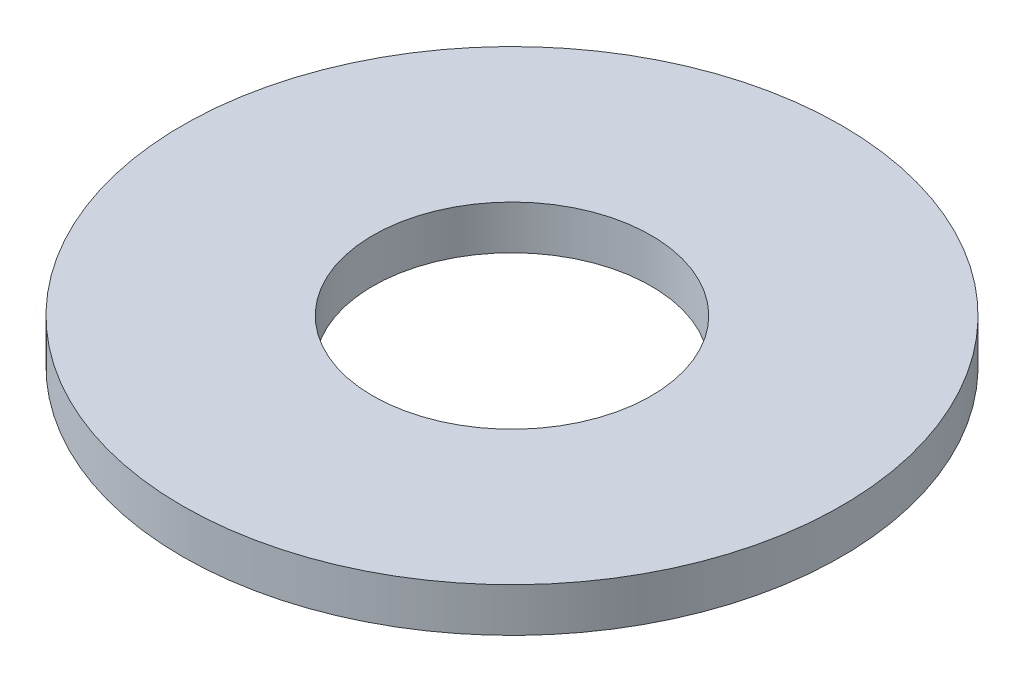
ISO-10303-21;
HEADER;
FILE_DESCRIPTION(('STEP AP214'),'2;1');
FILE_NAME('part.step','',(''),(''),'','','');
FILE_SCHEMA(('AUTOMOTIVE_DESIGN { 1 0 10303 214 1 1 1 1 }'));
ENDSEC;
DATA;
#1=APPLICATION_CONTEXT('core data for automotive mechanical design processes');
#2=APPLICATION_PROTOCOL_DEFINITION('international standard','automotive_design',2000,#1);
#3=PRODUCT_CONTEXT('',#1,'mechanical');
#4=PRODUCT('Part','Part','',(#3));
#5=PRODUCT_RELATED_PRODUCT_CATEGORY('part','',(#4));
#6=PRODUCT_DEFINITION_FORMATION('','',#4);
#7=PRODUCT_DEFINITION_CONTEXT('part definition',#1,'design');
#8=PRODUCT_DEFINITION('design','',#6,#7);
#9=PRODUCT_DEFINITION_SHAPE('','',#8);
#10=(LENGTH_UNIT() NAMED_UNIT(*) SI_UNIT(.MILLI.,.METRE.));
#11=(NAMED_UNIT(*) PLANE_ANGLE_UNIT() SI_UNIT($,.RADIAN.));
#12=(NAMED_UNIT(*) SI_UNIT($,.STERADIAN.) SOLID_ANGLE_UNIT());
#13=UNCERTAINTY_MEASURE_WITH_UNIT(LENGTH_MEASURE(1.E-05),#10,'distance_accuracy_value','');
#14=(GEOMETRIC_REPRESENTATION_CONTEXT(3) GLOBAL_UNCERTAINTY_ASSIGNED_CONTEXT((#13)) GLOBAL_UNIT_ASSIGNED_CONTEXT((#10,
#11,#12)) REPRESENTATION_CONTEXT('',''));
#15=CARTESIAN_POINT('',(0.,0.,0.));
#16=DIRECTION('',(0.,0.,1.));
#17=DIRECTION('',(1.,0.,0.));
#18=AXIS2_PLACEMENT_3D('',#15,#16,#17);
#19=CARTESIAN_POINT('',(0.,0.3,0.));
#20=DIRECTION('',(0.,1.,0.));
#21=DIRECTION('',(0.,0.,1.));
#22=AXIS2_PLACEMENT_3D('',#19,#20,#21);
#23=PLANE('',#22);
#24=CARTESIAN_POINT('',(0.,0.3,0.));
#25=DIRECTION('',(0.,1.,0.));
#26=DIRECTION('',(0.,0.,1.));
#27=AXIS2_PLACEMENT_3D('',#24,#25,#26);
#28=CIRCLE('',#27,2.25);
#29=CARTESIAN_POINT('',(0.,0.3,2.25));
#30=VERTEX_POINT('',#29);
#31=EDGE_CURVE('E10',#30,#30,#28,.T.);
#32=ORIENTED_EDGE('',*,*,#31,.T.);
#33=EDGE_LOOP('',(#32));
#34=FACE_BOUND('',#33,.T.);
#35=CARTESIAN_POINT('',(0.,0.3,0.));
#36=DIRECTION('',(0.,1.,0.));
#37=DIRECTION('',(0.,0.,1.));
#38=AXIS2_PLACEMENT_3D('',#35,#36,#37);
#39=CIRCLE('',#38,0.95);
#40=CARTESIAN_POINT('',(0.,0.3,0.95));
#41=VERTEX_POINT('',#40);
#42=EDGE_CURVE('E39',#41,#41,#39,.T.);
#43=ORIENTED_EDGE('',*,*,#42,.F.);
#44=EDGE_LOOP('',(#43));
#45=FACE_BOUND('',#44,.T.);
#46=ADVANCED_FACE('F28',(#34,#45),#23,.T.);
#47=CARTESIAN_POINT('',(0.,0.,0.));
#48=DIRECTION('',(0.,1.,0.));
#49=DIRECTION('',(0.,0.,1.));
#50=AXIS2_PLACEMENT_3D('',#47,#48,#49);
#51=PLANE('',#50);
#52=CARTESIAN_POINT('',(0.,0.,0.));
#53=DIRECTION('',(0.,1.,0.));
#54=DIRECTION('',(0.,0.,1.));
#55=AXIS2_PLACEMENT_3D('',#52,#53,#54);
#56=CIRCLE('',#55,2.25);
#57=CARTESIAN_POINT('',(0.,0.,2.25));
#58=VERTEX_POINT('',#57);
#59=EDGE_CURVE('E35',#58,#58,#56,.T.);
#60=ORIENTED_EDGE('',*,*,#59,.F.);
#61=EDGE_LOOP('',(#60));
#62=FACE_BOUND('',#61,.T.);
#63=CARTESIAN_POINT('',(0.,0.,0.));
#64=DIRECTION('',(0.,1.,0.));
#65=DIRECTION('',(0.,0.,1.));
#66=AXIS2_PLACEMENT_3D('',#63,#64,#65);
#67=CIRCLE('',#66,0.95);
#68=CARTESIAN_POINT('',(0.,0.,0.95));
#69=VERTEX_POINT('',#68);
#70=EDGE_CURVE('E43',#69,#69,#67,.T.);
#71=ORIENTED_EDGE('',*,*,#70,.T.);
#72=EDGE_LOOP('',(#71));
#73=FACE_BOUND('',#72,.T.);
#74=ADVANCED_FACE('F49',(#62,#73),#51,.F.);
#75=CARTESIAN_POINT('',(0.,0.3,0.));
#76=DIRECTION('',(0.,-1.,0.));
#77=DIRECTION('',(0.,0.,-1.));
#78=AXIS2_PLACEMENT_3D('',#75,#76,#77);
#79=CYLINDRICAL_SURFACE('',#78,2.25);
#80=ORIENTED_EDGE('',*,*,#31,.F.);
#81=EDGE_LOOP('',(#80));
#82=FACE_BOUND('',#81,.T.);
#83=ORIENTED_EDGE('',*,*,#59,.T.);
#84=EDGE_LOOP('',(#83));
#85=FACE_BOUND('',#84,.T.);
#86=ADVANCED_FACE('F30',(#82,#85),#79,.T.);
#87=CARTESIAN_POINT('',(0.,0.3,0.));
#88=DIRECTION('',(0.,-1.,0.));
#89=DIRECTION('',(0.,0.,-1.));
#90=AXIS2_PLACEMENT_3D('',#87,#88,#89);
#91=CYLINDRICAL_SURFACE('',#90,0.95);
#92=ORIENTED_EDGE('',*,*,#42,.T.);
#93=EDGE_LOOP('',(#92));
#94=FACE_BOUND('',#93,.T.);
#95=ORIENTED_EDGE('',*,*,#70,.F.);
#96=EDGE_LOOP('',(#95));
#97=FACE_BOUND('',#96,.T.);
#98=ADVANCED_FACE('F51',(#94,#97),#91,.F.);
#99=CLOSED_SHELL('',(#46,#74,#86,#98));
#100=MANIFOLD_SOLID_BREP('B2',#99);
#101=ADVANCED_BREP_SHAPE_REPRESENTATION('',(#18,#100),#14);
#102=SHAPE_DEFINITION_REPRESENTATION(#9,#101);
ENDSEC;
END-ISO-10303-21;
